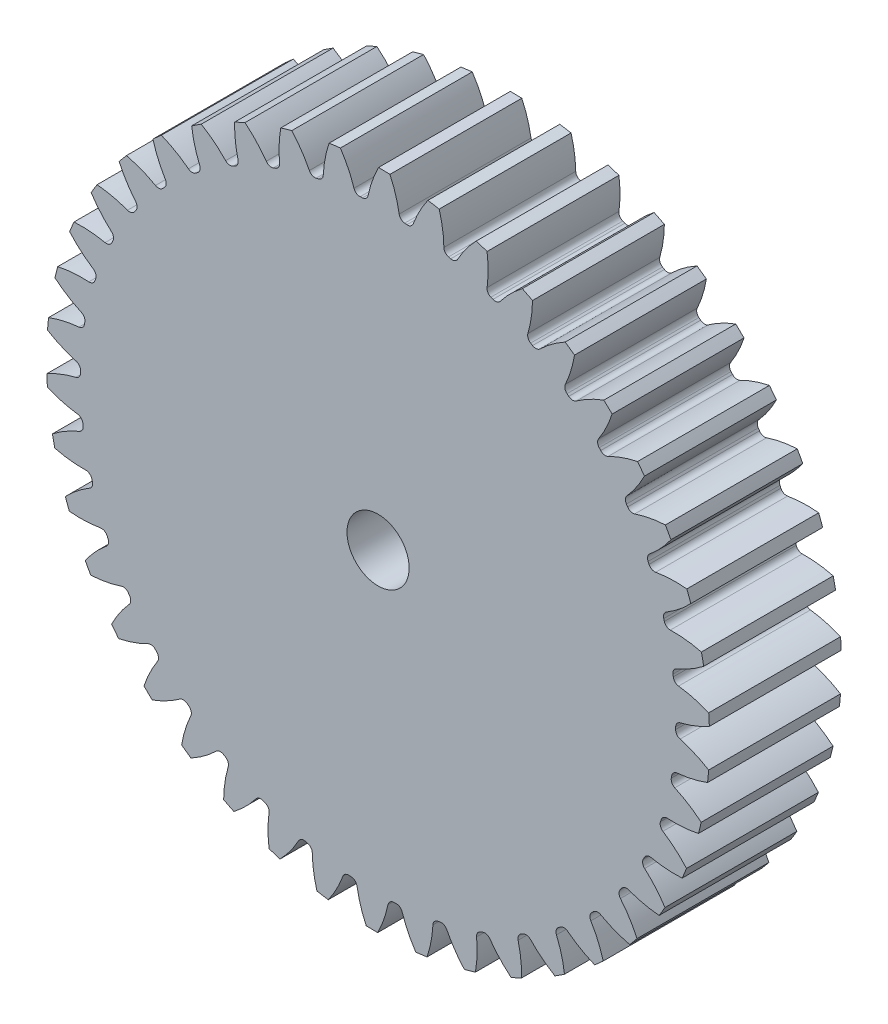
from build123d import *

# Parameters (mm, degrees)
SKETCH3_R         = 223.52
GEARBODY_DEPTH    = 88.9
TOOTHCUT_DEPTH    = 329.368072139
CIRPATTERN1_COUNT = 42
BOREDIA_R         = 20.955
BORE_DEPTH        = 12700


with BuildPart() as part:
    # Sketch3 → gearBody (new body)
    with BuildSketch(Plane.XY):
        Circle(SKETCH3_R)
    extrude(amount=GEARBODY_DEPTH)

    # Sketch2 → toothCut (cut, through all)
    with BuildSketch(Plane.XY):
        with BuildLine():
            ThreePointArc((200.610052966, -4.476857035), (200.625629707, -3.713799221), (200.638304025, -2.950687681))
            ThreePointArc((200.638304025, -2.950687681), (201.538416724, -0.435288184), (203.788677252, 1.004769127))
            ThreePointArc((203.788677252, 1.004769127), (213.921281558, 4.234900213), (223.52, 8.813985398))
            ThreePointArc((223.52, 8.813985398), (223.655396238, -4.140105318), (223.040668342, -17.080310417))
            ThreePointArc((223.040668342, -17.080310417), (213.617995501, -12.149118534), (203.611878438, -8.54619775))
            ThreePointArc((203.611878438, -8.54619775), (201.416455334, -7.023845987), (200.610052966, -4.476857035))
        make_face()
    toothcut = extrude(amount=TOOTHCUT_DEPTH, mode=Mode.SUBTRACT)

    # CirPattern1: toothCut ×42 about axis
    cirpattern1_axis = Axis((0, 0, 0), (0, 0, 1))
    for i in range(1, CIRPATTERN1_COUNT):
        add(toothcut.rotate(cirpattern1_axis, i * 360 / CIRPATTERN1_COUNT), mode=Mode.SUBTRACT)

    # boreDia → bore (cut, symmetric)
    with BuildSketch(Plane.XY):
        Circle(BOREDIA_R)
    extrude(amount=BORE_DEPTH, both=True, mode=Mode.SUBTRACT)


solid = part.part
